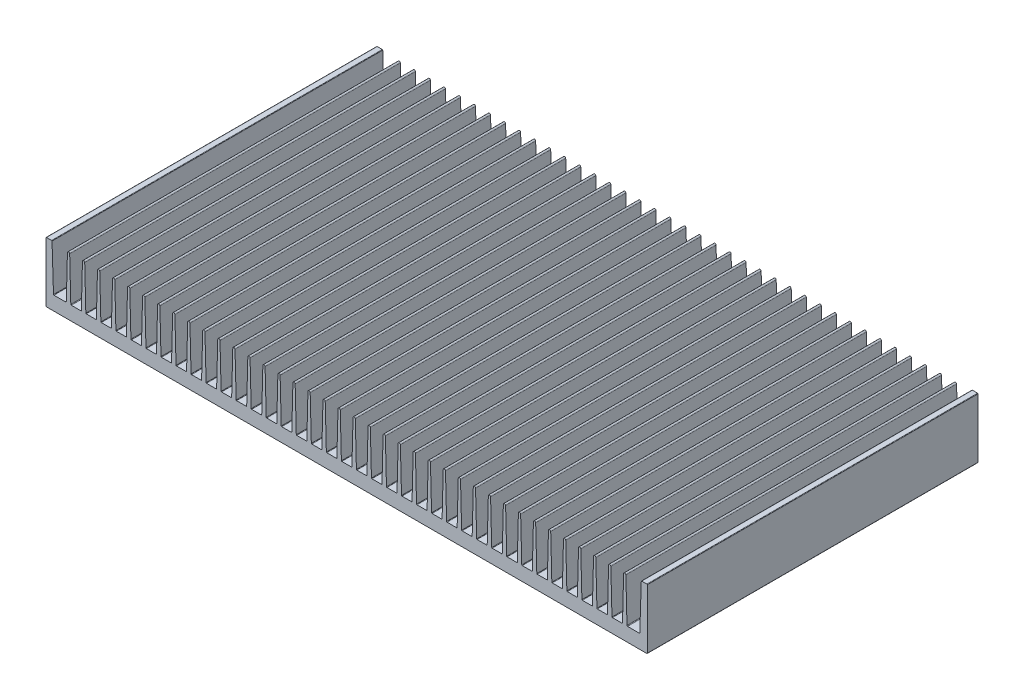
from build123d import *

# Parameters (mm, degrees)
LINEAR_AUSTRAGEN1_DEPTH = 220


with BuildPart() as part:
    # Skizze1 → Linear austragen1 (new body)
    with BuildSketch(Plane.XY.offset(10)):
        with BuildLine():
            Line((205.829345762, 23.438262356), (205.086639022, 52.215352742))
            ThreePointArc((205.086639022, 52.215352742), (204.336888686, 52.946002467), (203.58713835, 52.215352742))
            Line((203.58713835, 52.215352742), (202.844431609, 23.438262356))
            ThreePointArc((202.844431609, 23.438262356), (202.753909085, 23.231151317), (202.544531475, 23.146002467))
            Line((202.544531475, 23.146002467), (196.129245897, 23.146002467))
            ThreePointArc((196.129245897, 23.146002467), (195.919868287, 23.231151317), (195.829345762, 23.438262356))
            Line((195.829345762, 23.438262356), (195.086639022, 52.215352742))
            ThreePointArc((195.086639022, 52.215352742), (194.336888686, 52.946002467), (193.58713835, 52.215352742))
            Line((193.58713835, 52.215352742), (192.844431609, 23.438262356))
            ThreePointArc((192.844431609, 23.438262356), (192.753909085, 23.231151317), (192.544531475, 23.146002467))
            Line((192.544531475, 23.146002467), (186.129245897, 23.146002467))
            ThreePointArc((186.129245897, 23.146002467), (185.919868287, 23.231151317), (185.829345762, 23.438262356))
            Line((185.829345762, 23.438262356), (185.086639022, 52.215352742))
            ThreePointArc((185.086639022, 52.215352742), (184.336888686, 52.946002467), (183.58713835, 52.215352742))
            Line((183.58713835, 52.215352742), (182.844431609, 23.438262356))
            ThreePointArc((182.844431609, 23.438262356), (182.753909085, 23.231151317), (182.544531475, 23.146002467))
            Line((182.544531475, 23.146002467), (176.129245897, 23.146002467))
            ThreePointArc((176.129245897, 23.146002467), (175.919868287, 23.231151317), (175.829345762, 23.438262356))
            Line((175.829345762, 23.438262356), (175.086639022, 52.215352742))
            ThreePointArc((175.086639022, 52.215352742), (174.336888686, 52.946002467), (173.58713835, 52.215352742))
            Line((173.58713835, 52.215352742), (172.844431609, 23.438262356))
            ThreePointArc((172.844431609, 23.438262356), (172.753909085, 23.231151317), (172.544531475, 23.146002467))
            Line((172.544531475, 23.146002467), (166.129245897, 23.146002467))
            ThreePointArc((166.129245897, 23.146002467), (165.919868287, 23.231151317), (165.829345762, 23.438262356))
            Line((165.829345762, 23.438262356), (165.086639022, 52.215352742))
            ThreePointArc((165.086639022, 52.215352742), (164.336888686, 52.946002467), (163.58713835, 52.215352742))
            Line((163.58713835, 52.215352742), (162.844431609, 23.438262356))
            ThreePointArc((162.844431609, 23.438262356), (162.753909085, 23.231151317), (162.544531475, 23.146002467))
            Line((162.544531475, 23.146002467), (156.129245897, 23.146002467))
            ThreePointArc((156.129245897, 23.146002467), (155.919868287, 23.231151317), (155.829345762, 23.438262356))
            Line((155.829345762, 23.438262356), (155.086639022, 52.215352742))
            ThreePointArc((155.086639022, 52.215352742), (154.336888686, 52.946002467), (153.58713835, 52.215352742))
            Line((153.58713835, 52.215352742), (152.844431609, 23.438262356))
            ThreePointArc((152.844431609, 23.438262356), (152.753909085, 23.231151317), (152.544531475, 23.146002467))
            Line((152.544531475, 23.146002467), (146.129245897, 23.146002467))
            ThreePointArc((146.129245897, 23.146002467), (145.919868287, 23.231151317), (145.829345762, 23.438262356))
            Line((145.829345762, 23.438262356), (145.086639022, 52.215352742))
            ThreePointArc((145.086639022, 52.215352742), (144.336888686, 52.946002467), (143.58713835, 52.215352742))
            Line((143.58713835, 52.215352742), (142.844431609, 23.438262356))
            ThreePointArc((142.844431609, 23.438262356), (142.753909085, 23.231151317), (142.544531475, 23.146002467))
            Line((142.544531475, 23.146002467), (136.129245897, 23.146002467))
            ThreePointArc((136.129245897, 23.146002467), (135.919868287, 23.231151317), (135.829345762, 23.438262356))
            Line((135.829345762, 23.438262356), (135.086639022, 52.215352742))
            ThreePointArc((135.086639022, 52.215352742), (134.336888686, 52.946002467), (133.58713835, 52.215352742))
            Line((133.58713835, 52.215352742), (132.844431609, 23.438262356))
            ThreePointArc((132.844431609, 23.438262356), (132.753909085, 23.231151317), (132.544531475, 23.146002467))
            Line((132.544531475, 23.146002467), (126.129245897, 23.146002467))
            ThreePointArc((126.129245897, 23.146002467), (125.919868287, 23.231151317), (125.829345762, 23.438262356))
            Line((125.829345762, 23.438262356), (125.086639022, 52.215352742))
            ThreePointArc((125.086639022, 52.215352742), (124.336888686, 52.946002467), (123.58713835, 52.215352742))
            Line((123.58713835, 52.215352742), (122.844431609, 23.438262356))
            ThreePointArc((122.844431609, 23.438262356), (122.753909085, 23.231151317), (122.544531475, 23.146002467))
            Line((122.544531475, 23.146002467), (116.129245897, 23.146002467))
            ThreePointArc((116.129245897, 23.146002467), (115.919868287, 23.231151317), (115.829345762, 23.438262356))
            Line((115.829345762, 23.438262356), (115.086639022, 52.215352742))
            ThreePointArc((115.086639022, 52.215352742), (114.336888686, 52.946002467), (113.58713835, 52.215352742))
            Line((113.58713835, 52.215352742), (112.844431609, 23.438262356))
            ThreePointArc((112.844431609, 23.438262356), (112.753909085, 23.231151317), (112.544531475, 23.146002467))
            Line((112.544531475, 23.146002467), (106.129245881, 23.146002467))
            ThreePointArc((106.129245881, 23.146002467), (105.919868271, 23.231151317), (105.829345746, 23.438262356))
            Line((105.829345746, 23.438262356), (105.086635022, 52.215507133))
            ThreePointArc((105.086635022, 52.215507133), (104.336811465, 52.946002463), (103.58713835, 52.215352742))
            Line((103.58713835, 52.215352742), (102.844431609, 23.438262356))
            ThreePointArc((102.844431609, 23.438262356), (102.753909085, 23.231151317), (102.544531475, 23.146002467))
            Line((102.544531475, 23.146002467), (96.129245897, 23.146002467))
            ThreePointArc((96.129245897, 23.146002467), (95.919868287, 23.231151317), (95.829345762, 23.438262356))
            Line((95.829345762, 23.438262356), (95.086639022, 52.215352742))
            ThreePointArc((95.086639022, 52.215352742), (94.336888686, 52.946002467), (93.58713835, 52.215352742))
            Line((93.58713835, 52.215352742), (92.844431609, 23.438262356))
            ThreePointArc((92.844431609, 23.438262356), (92.753909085, 23.231151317), (92.544531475, 23.146002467))
            Line((92.544531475, 23.146002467), (86.129245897, 23.146002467))
            ThreePointArc((86.129245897, 23.146002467), (85.919868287, 23.231151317), (85.829345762, 23.438262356))
            Line((85.829345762, 23.438262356), (85.086639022, 52.215352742))
            ThreePointArc((85.086639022, 52.215352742), (84.336888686, 52.946002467), (83.58713835, 52.215352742))
            Line((83.58713835, 52.215352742), (82.844431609, 23.438262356))
            ThreePointArc((82.844431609, 23.438262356), (82.753909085, 23.231151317), (82.544531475, 23.146002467))
            Line((82.544531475, 23.146002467), (76.129245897, 23.146002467))
            ThreePointArc((76.129245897, 23.146002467), (75.919868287, 23.231151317), (75.829345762, 23.438262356))
            Line((75.829345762, 23.438262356), (75.086639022, 52.215352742))
            ThreePointArc((75.086639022, 52.215352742), (74.336888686, 52.946002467), (73.58713835, 52.215352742))
            Line((73.58713835, 52.215352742), (72.844431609, 23.438262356))
            ThreePointArc((72.844431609, 23.438262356), (72.753909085, 23.231151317), (72.544531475, 23.146002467))
            Line((72.544531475, 23.146002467), (66.129245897, 23.146002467))
            ThreePointArc((66.129245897, 23.146002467), (65.919868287, 23.231151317), (65.829345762, 23.438262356))
            Line((65.829345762, 23.438262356), (65.086639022, 52.215352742))
            ThreePointArc((65.086639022, 52.215352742), (64.336888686, 52.946002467), (63.58713835, 52.215352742))
            Line((63.58713835, 52.215352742), (62.844431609, 23.438262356))
            ThreePointArc((62.844431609, 23.438262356), (62.753909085, 23.231151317), (62.544531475, 23.146002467))
            Line((62.544531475, 23.146002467), (56.129245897, 23.146002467))
            ThreePointArc((56.129245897, 23.146002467), (55.919868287, 23.231151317), (55.829345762, 23.438262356))
            Line((55.829345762, 23.438262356), (55.086639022, 52.215352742))
            ThreePointArc((55.086639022, 52.215352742), (54.336888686, 52.946002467), (53.58713835, 52.215352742))
            Line((53.58713835, 52.215352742), (52.844431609, 23.438262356))
            ThreePointArc((52.844431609, 23.438262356), (52.753909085, 23.231151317), (52.544531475, 23.146002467))
            Line((52.544531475, 23.146002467), (46.129245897, 23.146002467))
            ThreePointArc((46.129245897, 23.146002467), (45.919868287, 23.231151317), (45.829345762, 23.438262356))
            Line((45.829345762, 23.438262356), (45.086639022, 52.215352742))
            ThreePointArc((45.086639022, 52.215352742), (44.336888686, 52.946002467), (43.58713835, 52.215352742))
            Line((43.58713835, 52.215352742), (42.844431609, 23.438262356))
            ThreePointArc((42.844431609, 23.438262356), (42.753909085, 23.231151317), (42.544531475, 23.146002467))
            Line((42.544531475, 23.146002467), (36.129245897, 23.146002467))
            ThreePointArc((36.129245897, 23.146002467), (35.919868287, 23.231151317), (35.829345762, 23.438262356))
            Line((35.829345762, 23.438262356), (35.086639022, 52.215352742))
            ThreePointArc((35.086639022, 52.215352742), (34.336888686, 52.946002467), (33.58713835, 52.215352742))
            Line((33.58713835, 52.215352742), (32.844431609, 23.438262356))
            ThreePointArc((32.844431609, 23.438262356), (32.753909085, 23.231151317), (32.544531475, 23.146002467))
            Line((32.544531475, 23.146002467), (26.129245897, 23.146002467))
            ThreePointArc((26.129245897, 23.146002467), (25.919868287, 23.231151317), (25.829345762, 23.438262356))
            Line((25.829345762, 23.438262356), (25.086639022, 52.215352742))
            ThreePointArc((25.086639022, 52.215352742), (24.336888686, 52.946002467), (23.58713835, 52.215352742))
            Line((23.58713835, 52.215352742), (22.844431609, 23.438262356))
            ThreePointArc((22.844431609, 23.438262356), (22.753909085, 23.231151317), (22.544531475, 23.146002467))
            Line((22.544531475, 23.146002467), (16.200885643, 23.146002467))
            ThreePointArc((16.200885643, 23.146002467), (15.94020176, 23.252016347), (15.827497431, 23.509878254))
            Line((15.827497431, 23.509878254), (15.086639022, 52.215352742))
            ThreePointArc((15.086639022, 52.215352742), (14.336888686, 52.946002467), (13.58713835, 52.215352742))
            Line((13.58713835, 52.215352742), (12.857191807, 23.932671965))
            ThreePointArc((12.857191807, 23.932671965), (12.613534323, 23.375195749), (12.049957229, 23.146002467))
            Line((12.049957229, 23.146002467), (4.627306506, 23.146002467))
            ThreePointArc((4.627306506, 23.146002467), (4.418644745, 23.230456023), (4.327464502, 23.436267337))
            Line((4.327464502, 23.436267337), (3.34631287, 53.655737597))
            ThreePointArc((3.34631287, 53.655737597), (3.255132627, 53.861548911), (3.046470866, 53.946002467))
            Line((3.046470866, 53.946002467), (-0.363111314, 53.946002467))
            ThreePointArc((-0.363111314, 53.946002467), (-0.575243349, 53.858134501), (-0.663111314, 53.646002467))
            Line((-0.663111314, 53.646002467), (-0.663111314, 14.246002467))
            ThreePointArc((-0.663111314, 14.246002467), (-0.575243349, 14.033870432), (-0.363111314, 13.946002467))
            Line((-0.363111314, 13.946002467), (399.036888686, 13.946002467))
            ThreePointArc((399.036888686, 13.946002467), (399.24902072, 14.033870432), (399.336888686, 14.246002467))
            Line((399.336888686, 14.246002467), (399.336888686, 53.656069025))
            ThreePointArc((399.336888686, 53.656069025), (399.249061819, 53.868159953), (399.037004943, 53.956069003))
            Line((399.037004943, 53.956069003), (395.627309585, 53.956069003))
            ThreePointArc((395.627309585, 53.956069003), (395.418646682, 53.871614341), (395.327467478, 53.665800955))
            Line((395.327467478, 53.665800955), (394.349450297, 23.53302653))
            ThreePointArc((394.349450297, 23.53302653), (394.227878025, 23.258608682), (393.949660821, 23.146002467))
            Line((393.949660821, 23.146002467), (386.226698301, 23.146002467))
            ThreePointArc((386.226698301, 23.146002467), (385.947528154, 23.259534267), (385.826831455, 23.53568232))
            Line((385.826831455, 23.53568232), (385.086639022, 52.215352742))
            ThreePointArc((385.086639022, 52.215352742), (384.336888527, 52.946002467), (383.587138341, 52.215352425))
            Line((383.587138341, 52.215352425), (382.846945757, 23.535206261))
            ThreePointArc((382.846945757, 23.535206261), (382.726249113, 23.259058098), (382.447078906, 23.145526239))
            Line((382.447078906, 23.145526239), (376.129258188, 23.145526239))
            ThreePointArc((376.129258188, 23.145526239), (375.919880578, 23.230675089), (375.829358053, 23.437786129))
            Line((375.829358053, 23.437786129), (375.086639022, 52.215352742))
            ThreePointArc((375.086639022, 52.215352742), (374.336888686, 52.946002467), (373.58713835, 52.215352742))
            Line((373.58713835, 52.215352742), (372.844431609, 23.438262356))
            ThreePointArc((372.844431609, 23.438262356), (372.753909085, 23.231151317), (372.544531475, 23.146002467))
            Line((372.544531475, 23.146002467), (366.129245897, 23.146002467))
            ThreePointArc((366.129245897, 23.146002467), (365.919868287, 23.231151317), (365.829345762, 23.438262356))
            Line((365.829345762, 23.438262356), (365.086639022, 52.215352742))
            ThreePointArc((365.086639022, 52.215352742), (364.336888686, 52.946002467), (363.58713835, 52.215352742))
            Line((363.58713835, 52.215352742), (362.844431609, 23.438262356))
            ThreePointArc((362.844431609, 23.438262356), (362.753909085, 23.231151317), (362.544531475, 23.146002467))
            Line((362.544531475, 23.146002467), (356.129245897, 23.146002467))
            ThreePointArc((356.129245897, 23.146002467), (355.919868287, 23.231151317), (355.829345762, 23.438262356))
            Line((355.829345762, 23.438262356), (355.086639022, 52.215352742))
            ThreePointArc((355.086639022, 52.215352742), (354.336888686, 52.946002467), (353.58713835, 52.215352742))
            Line((353.58713835, 52.215352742), (352.844431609, 23.438262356))
            ThreePointArc((352.844431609, 23.438262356), (352.753909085, 23.231151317), (352.544531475, 23.146002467))
            Line((352.544531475, 23.146002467), (346.129245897, 23.146002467))
            ThreePointArc((346.129245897, 23.146002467), (345.919868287, 23.231151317), (345.829345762, 23.438262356))
            Line((345.829345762, 23.438262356), (345.086639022, 52.215352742))
            ThreePointArc((345.086639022, 52.215352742), (344.336888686, 52.946002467), (343.58713835, 52.215352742))
            Line((343.58713835, 52.215352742), (342.844431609, 23.438262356))
            ThreePointArc((342.844431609, 23.438262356), (342.753909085, 23.231151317), (342.544531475, 23.146002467))
            Line((342.544531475, 23.146002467), (336.129245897, 23.146002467))
            ThreePointArc((336.129245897, 23.146002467), (335.919868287, 23.231151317), (335.829345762, 23.438262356))
            Line((335.829345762, 23.438262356), (335.086639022, 52.215352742))
            ThreePointArc((335.086639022, 52.215352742), (334.336888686, 52.946002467), (333.58713835, 52.215352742))
            Line((333.58713835, 52.215352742), (332.844431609, 23.438262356))
            ThreePointArc((332.844431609, 23.438262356), (332.753909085, 23.231151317), (332.544531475, 23.146002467))
            Line((332.544531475, 23.146002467), (326.129245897, 23.146002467))
            ThreePointArc((326.129245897, 23.146002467), (325.919868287, 23.231151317), (325.829345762, 23.438262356))
            Line((325.829345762, 23.438262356), (325.086639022, 52.215352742))
            ThreePointArc((325.086639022, 52.215352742), (324.336888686, 52.946002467), (323.58713835, 52.215352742))
            Line((323.58713835, 52.215352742), (322.844431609, 23.438262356))
            ThreePointArc((322.844431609, 23.438262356), (322.753909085, 23.231151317), (322.544531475, 23.146002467))
            Line((322.544531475, 23.146002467), (316.129245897, 23.146002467))
            ThreePointArc((316.129245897, 23.146002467), (315.919868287, 23.231151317), (315.829345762, 23.438262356))
            Line((315.829345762, 23.438262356), (315.086639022, 52.215352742))
            ThreePointArc((315.086639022, 52.215352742), (314.336888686, 52.946002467), (313.58713835, 52.215352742))
            Line((313.58713835, 52.215352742), (312.844431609, 23.438262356))
            ThreePointArc((312.844431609, 23.438262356), (312.753909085, 23.231151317), (312.544531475, 23.146002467))
            Line((312.544531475, 23.146002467), (306.129245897, 23.146002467))
            ThreePointArc((306.129245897, 23.146002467), (305.919868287, 23.231151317), (305.829345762, 23.438262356))
            Line((305.829345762, 23.438262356), (305.086639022, 52.215352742))
            ThreePointArc((305.086639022, 52.215352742), (304.336888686, 52.946002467), (303.58713835, 52.215352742))
            Line((303.58713835, 52.215352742), (302.844431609, 23.438262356))
            ThreePointArc((302.844431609, 23.438262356), (302.753909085, 23.231151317), (302.544531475, 23.146002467))
            Line((302.544531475, 23.146002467), (296.129245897, 23.146002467))
            ThreePointArc((296.129245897, 23.146002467), (295.919868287, 23.231151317), (295.829345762, 23.438262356))
            Line((295.829345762, 23.438262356), (295.086639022, 52.215352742))
            ThreePointArc((295.086639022, 52.215352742), (294.336888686, 52.946002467), (293.58713835, 52.215352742))
            Line((293.58713835, 52.215352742), (292.844431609, 23.438262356))
            ThreePointArc((292.844431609, 23.438262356), (292.753909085, 23.231151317), (292.544531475, 23.146002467))
            Line((292.544531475, 23.146002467), (286.129245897, 23.146002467))
            ThreePointArc((286.129245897, 23.146002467), (285.919868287, 23.231151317), (285.829345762, 23.438262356))
            Line((285.829345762, 23.438262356), (285.086639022, 52.215352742))
            ThreePointArc((285.086639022, 52.215352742), (284.336888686, 52.946002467), (283.58713835, 52.215352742))
            Line((283.58713835, 52.215352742), (282.844431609, 23.438262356))
            ThreePointArc((282.844431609, 23.438262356), (282.753909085, 23.231151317), (282.544531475, 23.146002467))
            Line((282.544531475, 23.146002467), (276.129245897, 23.146002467))
            ThreePointArc((276.129245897, 23.146002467), (275.919868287, 23.231151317), (275.829345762, 23.438262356))
            Line((275.829345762, 23.438262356), (275.086639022, 52.215352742))
            ThreePointArc((275.086639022, 52.215352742), (274.336888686, 52.946002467), (273.58713835, 52.215352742))
            Line((273.58713835, 52.215352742), (272.844431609, 23.438262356))
            ThreePointArc((272.844431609, 23.438262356), (272.753909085, 23.231151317), (272.544531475, 23.146002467))
            Line((272.544531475, 23.146002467), (266.129245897, 23.146002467))
            ThreePointArc((266.129245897, 23.146002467), (265.919868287, 23.231151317), (265.829345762, 23.438262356))
            Line((265.829345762, 23.438262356), (265.086639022, 52.215352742))
            ThreePointArc((265.086639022, 52.215352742), (264.336888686, 52.946002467), (263.58713835, 52.215352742))
            Line((263.58713835, 52.215352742), (262.844431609, 23.438262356))
            ThreePointArc((262.844431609, 23.438262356), (262.753909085, 23.231151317), (262.544531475, 23.146002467))
            Line((262.544531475, 23.146002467), (256.129245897, 23.146002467))
            ThreePointArc((256.129245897, 23.146002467), (255.919868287, 23.231151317), (255.829345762, 23.438262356))
            Line((255.829345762, 23.438262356), (255.086639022, 52.215352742))
            ThreePointArc((255.086639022, 52.215352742), (254.336888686, 52.946002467), (253.58713835, 52.215352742))
            Line((253.58713835, 52.215352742), (252.844431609, 23.438262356))
            ThreePointArc((252.844431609, 23.438262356), (252.753909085, 23.231151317), (252.544531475, 23.146002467))
            Line((252.544531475, 23.146002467), (246.129245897, 23.146002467))
            ThreePointArc((246.129245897, 23.146002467), (245.919868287, 23.231151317), (245.829345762, 23.438262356))
            Line((245.829345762, 23.438262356), (245.086639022, 52.215352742))
            ThreePointArc((245.086639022, 52.215352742), (244.336888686, 52.946002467), (243.58713835, 52.215352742))
            Line((243.58713835, 52.215352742), (242.844431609, 23.438262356))
            ThreePointArc((242.844431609, 23.438262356), (242.753909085, 23.231151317), (242.544531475, 23.146002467))
            Line((242.544531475, 23.146002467), (236.129245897, 23.146002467))
            ThreePointArc((236.129245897, 23.146002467), (235.919868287, 23.231151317), (235.829345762, 23.438262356))
            Line((235.829345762, 23.438262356), (235.086639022, 52.215352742))
            ThreePointArc((235.086639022, 52.215352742), (234.336888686, 52.946002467), (233.58713835, 52.215352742))
            Line((233.58713835, 52.215352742), (232.844431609, 23.438262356))
            ThreePointArc((232.844431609, 23.438262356), (232.753909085, 23.231151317), (232.544531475, 23.146002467))
            Line((232.544531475, 23.146002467), (226.129245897, 23.146002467))
            ThreePointArc((226.129245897, 23.146002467), (225.919868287, 23.231151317), (225.829345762, 23.438262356))
            Line((225.829345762, 23.438262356), (225.086639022, 52.215352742))
            ThreePointArc((225.086639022, 52.215352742), (224.336888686, 52.946002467), (223.58713835, 52.215352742))
            Line((223.58713835, 52.215352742), (222.844431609, 23.438262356))
            ThreePointArc((222.844431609, 23.438262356), (222.753909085, 23.231151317), (222.544531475, 23.146002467))
            Line((222.544531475, 23.146002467), (216.129245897, 23.146002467))
            ThreePointArc((216.129245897, 23.146002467), (215.919868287, 23.231151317), (215.829345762, 23.438262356))
            Line((215.829345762, 23.438262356), (215.086639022, 52.215352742))
            ThreePointArc((215.086639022, 52.215352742), (214.336888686, 52.946002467), (213.58713835, 52.215352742))
            Line((213.58713835, 52.215352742), (212.844431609, 23.438262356))
            ThreePointArc((212.844431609, 23.438262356), (212.753909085, 23.231151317), (212.544531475, 23.146002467))
            Line((212.544531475, 23.146002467), (206.129245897, 23.146002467))
            ThreePointArc((206.129245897, 23.146002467), (205.919868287, 23.231151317), (205.829345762, 23.438262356))
        make_face()
    extrude(amount=-LINEAR_AUSTRAGEN1_DEPTH)


solid = part.part
